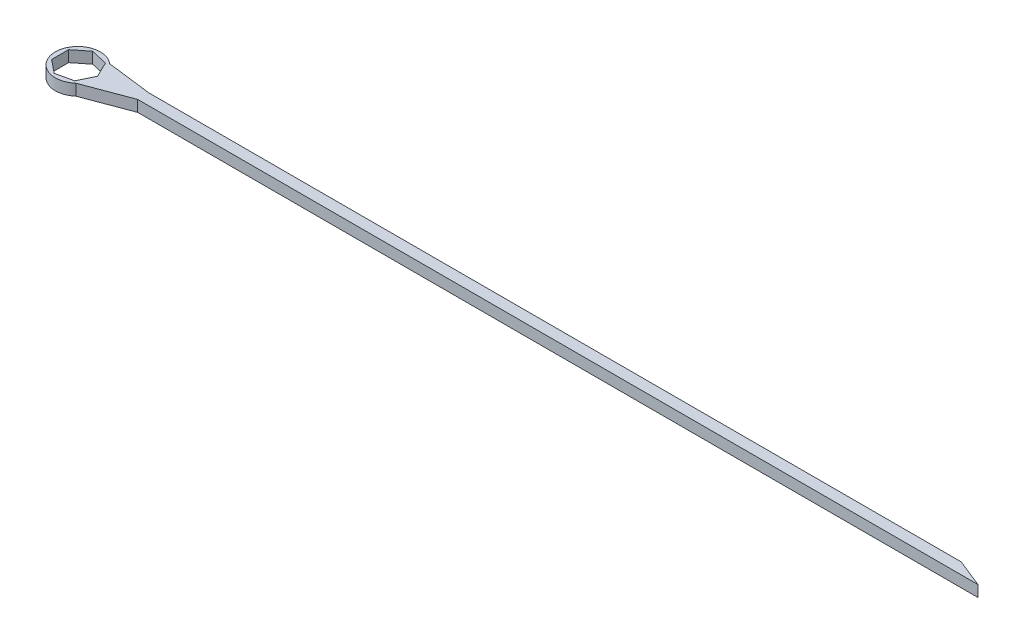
ISO-10303-21;
HEADER;
FILE_DESCRIPTION(('STEP AP214'),'2;1');
FILE_NAME('part.step','',(''),(''),'','','');
FILE_SCHEMA(('AUTOMOTIVE_DESIGN { 1 0 10303 214 1 1 1 1 }'));
ENDSEC;
DATA;
#1=APPLICATION_CONTEXT('core data for automotive mechanical design processes');
#2=APPLICATION_PROTOCOL_DEFINITION('international standard','automotive_design',2000,#1);
#3=PRODUCT_CONTEXT('',#1,'mechanical');
#4=PRODUCT('Part','Part','',(#3));
#5=PRODUCT_RELATED_PRODUCT_CATEGORY('part','',(#4));
#6=PRODUCT_DEFINITION_FORMATION('','',#4);
#7=PRODUCT_DEFINITION_CONTEXT('part definition',#1,'design');
#8=PRODUCT_DEFINITION('design','',#6,#7);
#9=PRODUCT_DEFINITION_SHAPE('','',#8);
#10=(LENGTH_UNIT() NAMED_UNIT(*) SI_UNIT(.MILLI.,.METRE.));
#11=(NAMED_UNIT(*) PLANE_ANGLE_UNIT() SI_UNIT($,.RADIAN.));
#12=(NAMED_UNIT(*) SI_UNIT($,.STERADIAN.) SOLID_ANGLE_UNIT());
#13=UNCERTAINTY_MEASURE_WITH_UNIT(LENGTH_MEASURE(1.E-05),#10,'distance_accuracy_value','');
#14=(GEOMETRIC_REPRESENTATION_CONTEXT(3) GLOBAL_UNCERTAINTY_ASSIGNED_CONTEXT((#13)) GLOBAL_UNIT_ASSIGNED_CONTEXT((#10,
#11,#12)) REPRESENTATION_CONTEXT('',''));
#15=CARTESIAN_POINT('',(0.,0.,0.));
#16=DIRECTION('',(0.,0.,1.));
#17=DIRECTION('',(1.,0.,0.));
#18=AXIS2_PLACEMENT_3D('',#15,#16,#17);
#19=CARTESIAN_POINT('',(0.,1.,0.));
#20=DIRECTION('',(0.,1.,0.));
#21=DIRECTION('',(0.,0.,1.));
#22=AXIS2_PLACEMENT_3D('',#19,#20,#21);
#23=PLANE('',#22);
#24=DIRECTION('',(0.936329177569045,0.,-0.351123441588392));
#25=VECTOR('',#24,1.);
#26=CARTESIAN_POINT('',(5.3228756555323,1.,0.));
#27=LINE('',#26,#25);
#28=CARTESIAN_POINT('',(1.3228756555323,1.,1.5));
#29=VERTEX_POINT('',#28);
#30=CARTESIAN_POINT('',(5.3228756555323,1.,0.));
#31=VERTEX_POINT('',#30);
#32=EDGE_CURVE('E185',#29,#31,#27,.T.);
#33=ORIENTED_EDGE('',*,*,#32,.T.);
#34=DIRECTION('',(1.,0.,0.));
#35=VECTOR('',#34,1.);
#36=CARTESIAN_POINT('',(5.3228756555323,1.,0.));
#37=LINE('',#36,#35);
#38=CARTESIAN_POINT('',(80.,1.,0.));
#39=VERTEX_POINT('',#38);
#40=EDGE_CURVE('E188',#31,#39,#37,.T.);
#41=ORIENTED_EDGE('',*,*,#40,.T.);
#42=DIRECTION('',(-0.928476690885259,0.,-0.371390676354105));
#43=VECTOR('',#42,1.);
#44=CARTESIAN_POINT('',(80.,1.,0.));
#45=LINE('',#44,#43);
#46=CARTESIAN_POINT('',(77.5,1.,-1.00000000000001));
#47=VERTEX_POINT('',#46);
#48=EDGE_CURVE('E191',#39,#47,#45,.T.);
#49=ORIENTED_EDGE('',*,*,#48,.T.);
#50=DIRECTION('',(-1.,0.,0.));
#51=VECTOR('',#50,1.);
#52=CARTESIAN_POINT('',(77.5,1.,-1.00000000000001));
#53=LINE('',#52,#51);
#54=CARTESIAN_POINT('',(5.3228756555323,1.,-0.999999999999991));
#55=VERTEX_POINT('',#54);
#56=EDGE_CURVE('E193',#47,#55,#53,.T.);
#57=ORIENTED_EDGE('',*,*,#56,.T.);
#58=DIRECTION('',(-0.992277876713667,0.,-0.124034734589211));
#59=VECTOR('',#58,1.);
#60=CARTESIAN_POINT('',(5.3228756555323,1.,-0.999999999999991));
#61=LINE('',#60,#59);
#62=CARTESIAN_POINT('',(1.3228756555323,1.,-1.5));
#63=VERTEX_POINT('',#62);
#64=EDGE_CURVE('E195',#55,#63,#61,.T.);
#65=ORIENTED_EDGE('',*,*,#64,.T.);
#66=CARTESIAN_POINT('',(0.,1.,0.));
#67=DIRECTION('',(0.,1.,0.));
#68=DIRECTION('',(0.,0.,1.));
#69=AXIS2_PLACEMENT_3D('',#66,#67,#68);
#70=CIRCLE('',#69,2.);
#71=EDGE_CURVE('E197',#63,#29,#70,.T.);
#72=ORIENTED_EDGE('',*,*,#71,.T.);
#73=EDGE_LOOP('',(#33,#41,#49,#57,#65,#72));
#74=FACE_BOUND('',#73,.T.);
#75=DIRECTION('',(-0.433883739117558,0.,-0.900968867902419));
#76=VECTOR('',#75,1.);
#77=CARTESIAN_POINT('',(1.75,1.,0.));
#78=LINE('',#77,#76);
#79=CARTESIAN_POINT('',(1.75,1.,0.));
#80=VERTEX_POINT('',#79);
#81=CARTESIAN_POINT('',(1.09110715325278,1.,-1.36820509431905));
#82=VERTEX_POINT('',#81);
#83=EDGE_CURVE('E135',#80,#82,#78,.T.);
#84=ORIENTED_EDGE('',*,*,#83,.F.);
#85=DIRECTION('',(0.433883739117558,0.,-0.900968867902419));
#86=VECTOR('',#85,1.);
#87=CARTESIAN_POINT('',(1.09110715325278,1.,1.36820509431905));
#88=LINE('',#87,#86);
#89=CARTESIAN_POINT('',(1.09110715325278,1.,1.36820509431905));
#90=VERTEX_POINT('',#89);
#91=EDGE_CURVE('E127',#90,#80,#88,.T.);
#92=ORIENTED_EDGE('',*,*,#91,.F.);
#93=DIRECTION('',(0.974927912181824,0.,-0.222520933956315));
#94=VECTOR('',#93,1.);
#95=CARTESIAN_POINT('',(-0.38941163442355,1.,1.70612384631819));
#96=LINE('',#95,#94);
#97=CARTESIAN_POINT('',(-0.38941163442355,1.,1.70612384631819));
#98=VERTEX_POINT('',#97);
#99=EDGE_CURVE('E158',#98,#90,#96,.T.);
#100=ORIENTED_EDGE('',*,*,#99,.F.);
#101=DIRECTION('',(0.78183148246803,0.,0.623489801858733));
#102=VECTOR('',#101,1.);
#103=CARTESIAN_POINT('',(-1.57669551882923,1.,0.759296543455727));
#104=LINE('',#103,#102);
#105=CARTESIAN_POINT('',(-1.57669551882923,1.,0.759296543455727));
#106=VERTEX_POINT('',#105);
#107=EDGE_CURVE('E156',#106,#98,#104,.T.);
#108=ORIENTED_EDGE('',*,*,#107,.F.);
#109=DIRECTION('',(0.,0.,1.));
#110=VECTOR('',#109,1.);
#111=CARTESIAN_POINT('',(-1.57669551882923,1.,-0.759296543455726));
#112=LINE('',#111,#110);
#113=CARTESIAN_POINT('',(-1.57669551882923,1.,-0.759296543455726));
#114=VERTEX_POINT('',#113);
#115=EDGE_CURVE('E154',#114,#106,#112,.T.);
#116=ORIENTED_EDGE('',*,*,#115,.F.);
#117=DIRECTION('',(-0.78183148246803,0.,0.623489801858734));
#118=VECTOR('',#117,1.);
#119=CARTESIAN_POINT('',(-0.389411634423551,1.,-1.70612384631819));
#120=LINE('',#119,#118);
#121=CARTESIAN_POINT('',(-0.389411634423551,1.,-1.70612384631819));
#122=VERTEX_POINT('',#121);
#123=EDGE_CURVE('E150',#122,#114,#120,.T.);
#124=ORIENTED_EDGE('',*,*,#123,.F.);
#125=DIRECTION('',(-0.974927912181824,0.,-0.222520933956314));
#126=VECTOR('',#125,1.);
#127=CARTESIAN_POINT('',(1.09110715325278,1.,-1.36820509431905));
#128=LINE('',#127,#126);
#129=EDGE_CURVE('E148',#82,#122,#128,.T.);
#130=ORIENTED_EDGE('',*,*,#129,.F.);
#131=EDGE_LOOP('',(#84,#92,#100,#108,#116,#124,#130));
#132=FACE_BOUND('',#131,.T.);
#133=ADVANCED_FACE('F32',(#74,#132),#23,.T.);
#134=CARTESIAN_POINT('',(0.,0.,0.));
#135=DIRECTION('',(0.,1.,0.));
#136=DIRECTION('',(0.,0.,1.));
#137=AXIS2_PLACEMENT_3D('',#134,#135,#136);
#138=PLANE('',#137);
#139=DIRECTION('',(0.936329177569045,0.,-0.351123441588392));
#140=VECTOR('',#139,1.);
#141=CARTESIAN_POINT('',(5.3228756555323,0.,0.));
#142=LINE('',#141,#140);
#143=CARTESIAN_POINT('',(1.3228756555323,0.,1.5));
#144=VERTEX_POINT('',#143);
#145=CARTESIAN_POINT('',(5.3228756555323,0.,0.));
#146=VERTEX_POINT('',#145);
#147=EDGE_CURVE('E143',#144,#146,#142,.T.);
#148=ORIENTED_EDGE('',*,*,#147,.F.);
#149=CARTESIAN_POINT('',(0.,0.,0.));
#150=DIRECTION('',(0.,1.,0.));
#151=DIRECTION('',(0.,0.,1.));
#152=AXIS2_PLACEMENT_3D('',#149,#150,#151);
#153=CIRCLE('',#152,2.);
#154=CARTESIAN_POINT('',(1.3228756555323,0.,-1.5));
#155=VERTEX_POINT('',#154);
#156=EDGE_CURVE('E189',#155,#144,#153,.T.);
#157=ORIENTED_EDGE('',*,*,#156,.F.);
#158=DIRECTION('',(-0.992277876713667,0.,-0.124034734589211));
#159=VECTOR('',#158,1.);
#160=CARTESIAN_POINT('',(5.3228756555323,0.,-0.999999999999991));
#161=LINE('',#160,#159);
#162=CARTESIAN_POINT('',(5.3228756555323,0.,-0.999999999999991));
#163=VERTEX_POINT('',#162);
#164=EDGE_CURVE('E208',#163,#155,#161,.T.);
#165=ORIENTED_EDGE('',*,*,#164,.F.);
#166=DIRECTION('',(-1.,0.,0.));
#167=VECTOR('',#166,1.);
#168=CARTESIAN_POINT('',(77.5,0.,-1.00000000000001));
#169=LINE('',#168,#167);
#170=CARTESIAN_POINT('',(77.5,0.,-1.00000000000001));
#171=VERTEX_POINT('',#170);
#172=EDGE_CURVE('E206',#171,#163,#169,.T.);
#173=ORIENTED_EDGE('',*,*,#172,.F.);
#174=DIRECTION('',(-0.928476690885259,0.,-0.371390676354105));
#175=VECTOR('',#174,1.);
#176=CARTESIAN_POINT('',(80.,0.,0.));
#177=LINE('',#176,#175);
#178=CARTESIAN_POINT('',(80.,0.,0.));
#179=VERTEX_POINT('',#178);
#180=EDGE_CURVE('E204',#179,#171,#177,.T.);
#181=ORIENTED_EDGE('',*,*,#180,.F.);
#182=DIRECTION('',(1.,0.,0.));
#183=VECTOR('',#182,1.);
#184=CARTESIAN_POINT('',(5.3228756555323,0.,0.));
#185=LINE('',#184,#183);
#186=EDGE_CURVE('E202',#146,#179,#185,.T.);
#187=ORIENTED_EDGE('',*,*,#186,.F.);
#188=EDGE_LOOP('',(#148,#157,#165,#173,#181,#187));
#189=FACE_BOUND('',#188,.T.);
#190=DIRECTION('',(0.433883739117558,0.,-0.900968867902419));
#191=VECTOR('',#190,1.);
#192=CARTESIAN_POINT('',(1.09110715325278,0.,1.36820509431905));
#193=LINE('',#192,#191);
#194=CARTESIAN_POINT('',(1.09110715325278,0.,1.36820509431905));
#195=VERTEX_POINT('',#194);
#196=CARTESIAN_POINT('',(1.75,0.,0.));
#197=VERTEX_POINT('',#196);
#198=EDGE_CURVE('E55',#195,#197,#193,.T.);
#199=ORIENTED_EDGE('',*,*,#198,.T.);
#200=DIRECTION('',(-0.433883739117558,0.,-0.900968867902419));
#201=VECTOR('',#200,1.);
#202=CARTESIAN_POINT('',(1.75,0.,0.));
#203=LINE('',#202,#201);
#204=CARTESIAN_POINT('',(1.09110715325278,0.,-1.36820509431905));
#205=VERTEX_POINT('',#204);
#206=EDGE_CURVE('E142',#197,#205,#203,.T.);
#207=ORIENTED_EDGE('',*,*,#206,.T.);
#208=DIRECTION('',(-0.974927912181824,0.,-0.222520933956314));
#209=VECTOR('',#208,1.);
#210=CARTESIAN_POINT('',(1.09110715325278,0.,-1.36820509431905));
#211=LINE('',#210,#209);
#212=CARTESIAN_POINT('',(-0.389411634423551,0.,-1.70612384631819));
#213=VERTEX_POINT('',#212);
#214=EDGE_CURVE('E162',#205,#213,#211,.T.);
#215=ORIENTED_EDGE('',*,*,#214,.T.);
#216=DIRECTION('',(-0.78183148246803,0.,0.623489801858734));
#217=VECTOR('',#216,1.);
#218=CARTESIAN_POINT('',(-0.389411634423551,0.,-1.70612384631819));
#219=LINE('',#218,#217);
#220=CARTESIAN_POINT('',(-1.57669551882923,0.,-0.759296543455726));
#221=VERTEX_POINT('',#220);
#222=EDGE_CURVE('E165',#213,#221,#219,.T.);
#223=ORIENTED_EDGE('',*,*,#222,.T.);
#224=DIRECTION('',(0.,0.,1.));
#225=VECTOR('',#224,1.);
#226=CARTESIAN_POINT('',(-1.57669551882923,0.,-0.759296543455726));
#227=LINE('',#226,#225);
#228=CARTESIAN_POINT('',(-1.57669551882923,0.,0.759296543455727));
#229=VERTEX_POINT('',#228);
#230=EDGE_CURVE('E168',#221,#229,#227,.T.);
#231=ORIENTED_EDGE('',*,*,#230,.T.);
#232=DIRECTION('',(0.78183148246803,0.,0.623489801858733));
#233=VECTOR('',#232,1.);
#234=CARTESIAN_POINT('',(-1.57669551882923,0.,0.759296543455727));
#235=LINE('',#234,#233);
#236=CARTESIAN_POINT('',(-0.38941163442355,0.,1.70612384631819));
#237=VERTEX_POINT('',#236);
#238=EDGE_CURVE('E171',#229,#237,#235,.T.);
#239=ORIENTED_EDGE('',*,*,#238,.T.);
#240=DIRECTION('',(0.974927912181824,0.,-0.222520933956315));
#241=VECTOR('',#240,1.);
#242=CARTESIAN_POINT('',(-0.38941163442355,0.,1.70612384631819));
#243=LINE('',#242,#241);
#244=EDGE_CURVE('E136',#237,#195,#243,.T.);
#245=ORIENTED_EDGE('',*,*,#244,.T.);
#246=EDGE_LOOP('',(#199,#207,#215,#223,#231,#239,#245));
#247=FACE_BOUND('',#246,.T.);
#248=ADVANCED_FACE('F232',(#189,#247),#138,.F.);
#249=CARTESIAN_POINT('',(5.3228756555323,1.,0.));
#250=DIRECTION('',(-0.351123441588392,0.,-0.936329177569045));
#251=DIRECTION('',(-0.936329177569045,0.,0.351123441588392));
#252=AXIS2_PLACEMENT_3D('',#249,#250,#251);
#253=PLANE('',#252);
#254=ORIENTED_EDGE('',*,*,#147,.T.);
#255=DIRECTION('',(0.,-1.,0.));
#256=VECTOR('',#255,1.);
#257=CARTESIAN_POINT('',(5.3228756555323,1.,0.));
#258=LINE('',#257,#256);
#259=EDGE_CURVE('E11',#31,#146,#258,.T.);
#260=ORIENTED_EDGE('',*,*,#259,.F.);
#261=ORIENTED_EDGE('',*,*,#32,.F.);
#262=DIRECTION('',(0.,-1.,0.));
#263=VECTOR('',#262,1.);
#264=CARTESIAN_POINT('',(1.3228756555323,1.,1.5));
#265=LINE('',#264,#263);
#266=EDGE_CURVE('E199',#29,#144,#265,.T.);
#267=ORIENTED_EDGE('',*,*,#266,.T.);
#268=EDGE_LOOP('',(#254,#260,#261,#267));
#269=FACE_BOUND('',#268,.T.);
#270=ADVANCED_FACE('F34',(#269),#253,.F.);
#271=CARTESIAN_POINT('',(5.3228756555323,1.,0.));
#272=DIRECTION('',(0.,0.,-1.));
#273=DIRECTION('',(-1.,0.,0.));
#274=AXIS2_PLACEMENT_3D('',#271,#272,#273);
#275=PLANE('',#274);
#276=ORIENTED_EDGE('',*,*,#186,.T.);
#277=DIRECTION('',(0.,-1.,0.));
#278=VECTOR('',#277,1.);
#279=CARTESIAN_POINT('',(80.,1.,0.));
#280=LINE('',#279,#278);
#281=EDGE_CURVE('E40',#39,#179,#280,.T.);
#282=ORIENTED_EDGE('',*,*,#281,.F.);
#283=ORIENTED_EDGE('',*,*,#40,.F.);
#284=ORIENTED_EDGE('',*,*,#259,.T.);
#285=EDGE_LOOP('',(#276,#282,#283,#284));
#286=FACE_BOUND('',#285,.T.);
#287=ADVANCED_FACE('F249',(#286),#275,.F.);
#288=CARTESIAN_POINT('',(80.,1.,0.));
#289=DIRECTION('',(-0.371390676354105,0.,0.928476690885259));
#290=DIRECTION('',(0.928476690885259,0.,0.371390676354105));
#291=AXIS2_PLACEMENT_3D('',#288,#289,#290);
#292=PLANE('',#291);
#293=ORIENTED_EDGE('',*,*,#180,.T.);
#294=DIRECTION('',(0.,-1.,0.));
#295=VECTOR('',#294,1.);
#296=CARTESIAN_POINT('',(77.5,1.,-1.00000000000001));
#297=LINE('',#296,#295);
#298=EDGE_CURVE('E219',#47,#171,#297,.T.);
#299=ORIENTED_EDGE('',*,*,#298,.F.);
#300=ORIENTED_EDGE('',*,*,#48,.F.);
#301=ORIENTED_EDGE('',*,*,#281,.T.);
#302=EDGE_LOOP('',(#293,#299,#300,#301));
#303=FACE_BOUND('',#302,.T.);
#304=ADVANCED_FACE('F226',(#303),#292,.F.);
#305=CARTESIAN_POINT('',(77.5,1.,-1.00000000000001));
#306=DIRECTION('',(0.,0.,1.));
#307=DIRECTION('',(1.,0.,0.));
#308=AXIS2_PLACEMENT_3D('',#305,#306,#307);
#309=PLANE('',#308);
#310=ORIENTED_EDGE('',*,*,#172,.T.);
#311=DIRECTION('',(0.,-1.,0.));
#312=VECTOR('',#311,1.);
#313=CARTESIAN_POINT('',(5.3228756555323,1.,-0.999999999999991));
#314=LINE('',#313,#312);
#315=EDGE_CURVE('E216',#55,#163,#314,.T.);
#316=ORIENTED_EDGE('',*,*,#315,.F.);
#317=ORIENTED_EDGE('',*,*,#56,.F.);
#318=ORIENTED_EDGE('',*,*,#298,.T.);
#319=EDGE_LOOP('',(#310,#316,#317,#318));
#320=FACE_BOUND('',#319,.T.);
#321=ADVANCED_FACE('F238',(#320),#309,.F.);
#322=CARTESIAN_POINT('',(5.3228756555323,1.,-0.999999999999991));
#323=DIRECTION('',(-0.124034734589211,0.,0.992277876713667));
#324=DIRECTION('',(0.992277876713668,0.,0.124034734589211));
#325=AXIS2_PLACEMENT_3D('',#322,#323,#324);
#326=PLANE('',#325);
#327=ORIENTED_EDGE('',*,*,#164,.T.);
#328=DIRECTION('',(0.,-1.,0.));
#329=VECTOR('',#328,1.);
#330=CARTESIAN_POINT('',(1.3228756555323,1.,-1.5));
#331=LINE('',#330,#329);
#332=EDGE_CURVE('E213',#63,#155,#331,.T.);
#333=ORIENTED_EDGE('',*,*,#332,.F.);
#334=ORIENTED_EDGE('',*,*,#64,.F.);
#335=ORIENTED_EDGE('',*,*,#315,.T.);
#336=EDGE_LOOP('',(#327,#333,#334,#335));
#337=FACE_BOUND('',#336,.T.);
#338=ADVANCED_FACE('F242',(#337),#326,.F.);
#339=CARTESIAN_POINT('',(0.,1.,0.));
#340=DIRECTION('',(0.,-1.,0.));
#341=DIRECTION('',(0.,0.,-1.));
#342=AXIS2_PLACEMENT_3D('',#339,#340,#341);
#343=CYLINDRICAL_SURFACE('',#342,2.);
#344=ORIENTED_EDGE('',*,*,#156,.T.);
#345=ORIENTED_EDGE('',*,*,#266,.F.);
#346=ORIENTED_EDGE('',*,*,#71,.F.);
#347=ORIENTED_EDGE('',*,*,#332,.T.);
#348=EDGE_LOOP('',(#344,#345,#346,#347));
#349=FACE_BOUND('',#348,.T.);
#350=ADVANCED_FACE('F252',(#349),#343,.T.);
#351=CARTESIAN_POINT('',(1.09110715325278,1.,1.36820509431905));
#352=DIRECTION('',(-0.900968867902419,0.,-0.433883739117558));
#353=DIRECTION('',(-0.433883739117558,0.,0.900968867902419));
#354=AXIS2_PLACEMENT_3D('',#351,#352,#353);
#355=PLANE('',#354);
#356=ORIENTED_EDGE('',*,*,#198,.F.);
#357=DIRECTION('',(0.,-1.,0.));
#358=VECTOR('',#357,1.);
#359=CARTESIAN_POINT('',(1.09110715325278,1.,1.36820509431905));
#360=LINE('',#359,#358);
#361=EDGE_CURVE('E131',#90,#195,#360,.T.);
#362=ORIENTED_EDGE('',*,*,#361,.F.);
#363=ORIENTED_EDGE('',*,*,#91,.T.);
#364=DIRECTION('',(0.,-1.,0.));
#365=VECTOR('',#364,1.);
#366=CARTESIAN_POINT('',(1.75,1.,0.));
#367=LINE('',#366,#365);
#368=EDGE_CURVE('E130',#80,#197,#367,.T.);
#369=ORIENTED_EDGE('',*,*,#368,.T.);
#370=EDGE_LOOP('',(#356,#362,#363,#369));
#371=FACE_BOUND('',#370,.T.);
#372=ADVANCED_FACE('F129',(#371),#355,.T.);
#373=CARTESIAN_POINT('',(1.75,1.,0.));
#374=DIRECTION('',(-0.900968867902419,0.,0.433883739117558));
#375=DIRECTION('',(0.433883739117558,0.,0.900968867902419));
#376=AXIS2_PLACEMENT_3D('',#373,#374,#375);
#377=PLANE('',#376);
#378=ORIENTED_EDGE('',*,*,#206,.F.);
#379=ORIENTED_EDGE('',*,*,#368,.F.);
#380=ORIENTED_EDGE('',*,*,#83,.T.);
#381=DIRECTION('',(0.,-1.,0.));
#382=VECTOR('',#381,1.);
#383=CARTESIAN_POINT('',(1.09110715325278,1.,-1.36820509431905));
#384=LINE('',#383,#382);
#385=EDGE_CURVE('E144',#82,#205,#384,.T.);
#386=ORIENTED_EDGE('',*,*,#385,.T.);
#387=EDGE_LOOP('',(#378,#379,#380,#386));
#388=FACE_BOUND('',#387,.T.);
#389=ADVANCED_FACE('F139',(#388),#377,.T.);
#390=CARTESIAN_POINT('',(1.09110715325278,1.,-1.36820509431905));
#391=DIRECTION('',(-0.222520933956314,0.,0.974927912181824));
#392=DIRECTION('',(0.974927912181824,0.,0.222520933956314));
#393=AXIS2_PLACEMENT_3D('',#390,#391,#392);
#394=PLANE('',#393);
#395=ORIENTED_EDGE('',*,*,#214,.F.);
#396=ORIENTED_EDGE('',*,*,#385,.F.);
#397=ORIENTED_EDGE('',*,*,#129,.T.);
#398=DIRECTION('',(0.,-1.,0.));
#399=VECTOR('',#398,1.);
#400=CARTESIAN_POINT('',(-0.389411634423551,1.,-1.70612384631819));
#401=LINE('',#400,#399);
#402=EDGE_CURVE('E182',#122,#213,#401,.T.);
#403=ORIENTED_EDGE('',*,*,#402,.T.);
#404=EDGE_LOOP('',(#395,#396,#397,#403));
#405=FACE_BOUND('',#404,.T.);
#406=ADVANCED_FACE('F270',(#405),#394,.T.);
#407=CARTESIAN_POINT('',(-0.389411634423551,1.,-1.70612384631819));
#408=DIRECTION('',(0.623489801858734,0.,0.78183148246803));
#409=DIRECTION('',(0.78183148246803,0.,-0.623489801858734));
#410=AXIS2_PLACEMENT_3D('',#407,#408,#409);
#411=PLANE('',#410);
#412=ORIENTED_EDGE('',*,*,#222,.F.);
#413=ORIENTED_EDGE('',*,*,#402,.F.);
#414=ORIENTED_EDGE('',*,*,#123,.T.);
#415=DIRECTION('',(0.,-1.,0.));
#416=VECTOR('',#415,1.);
#417=CARTESIAN_POINT('',(-1.57669551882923,1.,-0.759296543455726));
#418=LINE('',#417,#416);
#419=EDGE_CURVE('E180',#114,#221,#418,.T.);
#420=ORIENTED_EDGE('',*,*,#419,.T.);
#421=EDGE_LOOP('',(#412,#413,#414,#420));
#422=FACE_BOUND('',#421,.T.);
#423=ADVANCED_FACE('F273',(#422),#411,.T.);
#424=CARTESIAN_POINT('',(-1.57669551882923,1.,-0.759296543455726));
#425=DIRECTION('',(1.,0.,0.));
#426=DIRECTION('',(0.,0.,-1.));
#427=AXIS2_PLACEMENT_3D('',#424,#425,#426);
#428=PLANE('',#427);
#429=ORIENTED_EDGE('',*,*,#230,.F.);
#430=ORIENTED_EDGE('',*,*,#419,.F.);
#431=ORIENTED_EDGE('',*,*,#115,.T.);
#432=DIRECTION('',(0.,-1.,0.));
#433=VECTOR('',#432,1.);
#434=CARTESIAN_POINT('',(-1.57669551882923,1.,0.759296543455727));
#435=LINE('',#434,#433);
#436=EDGE_CURVE('E178',#106,#229,#435,.T.);
#437=ORIENTED_EDGE('',*,*,#436,.T.);
#438=EDGE_LOOP('',(#429,#430,#431,#437));
#439=FACE_BOUND('',#438,.T.);
#440=ADVANCED_FACE('F277',(#439),#428,.T.);
#441=CARTESIAN_POINT('',(-1.57669551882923,1.,0.759296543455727));
#442=DIRECTION('',(0.623489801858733,0.,-0.78183148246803));
#443=DIRECTION('',(-0.78183148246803,0.,-0.623489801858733));
#444=AXIS2_PLACEMENT_3D('',#441,#442,#443);
#445=PLANE('',#444);
#446=ORIENTED_EDGE('',*,*,#238,.F.);
#447=ORIENTED_EDGE('',*,*,#436,.F.);
#448=ORIENTED_EDGE('',*,*,#107,.T.);
#449=DIRECTION('',(0.,-1.,0.));
#450=VECTOR('',#449,1.);
#451=CARTESIAN_POINT('',(-0.38941163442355,1.,1.70612384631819));
#452=LINE('',#451,#450);
#453=EDGE_CURVE('E47',#98,#237,#452,.T.);
#454=ORIENTED_EDGE('',*,*,#453,.T.);
#455=EDGE_LOOP('',(#446,#447,#448,#454));
#456=FACE_BOUND('',#455,.T.);
#457=ADVANCED_FACE('F281',(#456),#445,.T.);
#458=CARTESIAN_POINT('',(-0.38941163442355,1.,1.70612384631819));
#459=DIRECTION('',(-0.222520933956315,0.,-0.974927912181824));
#460=DIRECTION('',(-0.974927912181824,0.,0.222520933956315));
#461=AXIS2_PLACEMENT_3D('',#458,#459,#460);
#462=PLANE('',#461);
#463=ORIENTED_EDGE('',*,*,#244,.F.);
#464=ORIENTED_EDGE('',*,*,#453,.F.);
#465=ORIENTED_EDGE('',*,*,#99,.T.);
#466=ORIENTED_EDGE('',*,*,#361,.T.);
#467=EDGE_LOOP('',(#463,#464,#465,#466));
#468=FACE_BOUND('',#467,.T.);
#469=ADVANCED_FACE('F285',(#468),#462,.T.);
#470=CLOSED_SHELL('',(#133,#248,#270,#287,#304,#321,#338,#350,#372,#389,#406,#423,#440,#457,#469));
#471=MANIFOLD_SOLID_BREP('B2',#470);
#472=ADVANCED_BREP_SHAPE_REPRESENTATION('',(#18,#471),#14);
#473=SHAPE_DEFINITION_REPRESENTATION(#9,#472);
ENDSEC;
END-ISO-10303-21;
